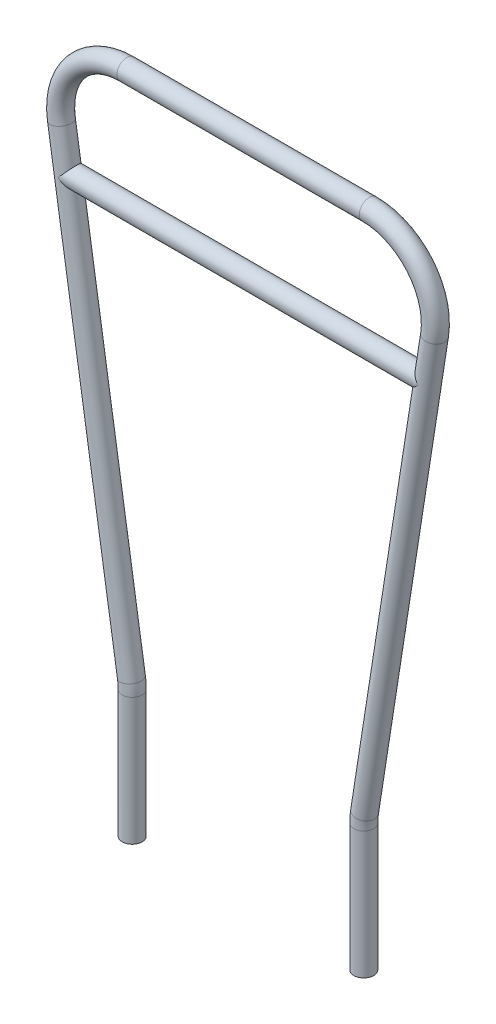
ISO-10303-21;
HEADER;
FILE_DESCRIPTION(('STEP AP214'),'2;1');
FILE_NAME('part.step','',(''),(''),'','','');
FILE_SCHEMA(('AUTOMOTIVE_DESIGN { 1 0 10303 214 1 1 1 1 }'));
ENDSEC;
DATA;
#1=APPLICATION_CONTEXT('core data for automotive mechanical design processes');
#2=APPLICATION_PROTOCOL_DEFINITION('international standard','automotive_design',2000,#1);
#3=PRODUCT_CONTEXT('',#1,'mechanical');
#4=PRODUCT('Part','Part','',(#3));
#5=PRODUCT_RELATED_PRODUCT_CATEGORY('part','',(#4));
#6=PRODUCT_DEFINITION_FORMATION('','',#4);
#7=PRODUCT_DEFINITION_CONTEXT('part definition',#1,'design');
#8=PRODUCT_DEFINITION('design','',#6,#7);
#9=PRODUCT_DEFINITION_SHAPE('','',#8);
#10=(LENGTH_UNIT() NAMED_UNIT(*) SI_UNIT(.MILLI.,.METRE.));
#11=(NAMED_UNIT(*) PLANE_ANGLE_UNIT() SI_UNIT($,.RADIAN.));
#12=(NAMED_UNIT(*) SI_UNIT($,.STERADIAN.) SOLID_ANGLE_UNIT());
#13=UNCERTAINTY_MEASURE_WITH_UNIT(LENGTH_MEASURE(1.E-05),#10,'distance_accuracy_value','');
#14=(GEOMETRIC_REPRESENTATION_CONTEXT(3) GLOBAL_UNCERTAINTY_ASSIGNED_CONTEXT((#13)) GLOBAL_UNIT_ASSIGNED_CONTEXT((#10,
#11,#12)) REPRESENTATION_CONTEXT('',''));
#15=CARTESIAN_POINT('',(0.,0.,0.));
#16=DIRECTION('',(0.,0.,1.));
#17=DIRECTION('',(1.,0.,0.));
#18=AXIS2_PLACEMENT_3D('',#15,#16,#17);
#19=CARTESIAN_POINT('',(350.,192.234610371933,0.));
#20=DIRECTION('',(0.,-1.,0.));
#21=DIRECTION('',(0.,0.,-1.));
#22=AXIS2_PLACEMENT_3D('',#19,#20,#21);
#23=CYLINDRICAL_SURFACE('',#22,15.);
#24=CARTESIAN_POINT('',(350.,192.234610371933,0.));
#25=DIRECTION('',(0.,-1.,0.));
#26=DIRECTION('',(0.,0.,1.));
#27=AXIS2_PLACEMENT_3D('',#24,#25,#26);
#28=CIRCLE('',#27,15.);
#29=CARTESIAN_POINT('',(335.,192.234610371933,0.));
#30=VERTEX_POINT('',#29);
#31=EDGE_CURVE('E170',#30,#30,#28,.T.);
#32=ORIENTED_EDGE('',*,*,#31,.T.);
#33=EDGE_LOOP('',(#32));
#34=FACE_BOUND('',#33,.T.);
#35=CARTESIAN_POINT('',(350.,-3.33066907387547E-13,0.));
#36=DIRECTION('',(0.,-1.,0.));
#37=DIRECTION('',(0.,0.,1.));
#38=AXIS2_PLACEMENT_3D('',#35,#36,#37);
#39=CIRCLE('',#38,15.);
#40=CARTESIAN_POINT('',(350.,-3.33066907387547E-13,15.));
#41=VERTEX_POINT('',#40);
#42=EDGE_CURVE('E11',#41,#41,#39,.T.);
#43=ORIENTED_EDGE('',*,*,#42,.F.);
#44=EDGE_LOOP('',(#43));
#45=FACE_BOUND('',#44,.T.);
#46=ADVANCED_FACE('F25',(#34,#45),#23,.T.);
#47=CARTESIAN_POINT('',(350.,192.234610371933,0.));
#48=DIRECTION('',(0.,-1.,0.));
#49=DIRECTION('',(0.,0.,-1.));
#50=AXIS2_PLACEMENT_3D('',#47,#48,#49);
#51=CYLINDRICAL_SURFACE('',#50,13.);
#52=CARTESIAN_POINT('',(350.,192.234610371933,0.));
#53=DIRECTION('',(0.,-1.,0.));
#54=DIRECTION('',(0.,0.,1.));
#55=AXIS2_PLACEMENT_3D('',#52,#53,#54);
#56=CIRCLE('',#55,13.);
#57=CARTESIAN_POINT('',(337.,192.234610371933,0.));
#58=VERTEX_POINT('',#57);
#59=EDGE_CURVE('E167',#58,#58,#56,.T.);
#60=ORIENTED_EDGE('',*,*,#59,.F.);
#61=EDGE_LOOP('',(#60));
#62=FACE_BOUND('',#61,.T.);
#63=CARTESIAN_POINT('',(350.,-3.33066907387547E-13,0.));
#64=DIRECTION('',(0.,-1.,0.));
#65=DIRECTION('',(0.,0.,1.));
#66=AXIS2_PLACEMENT_3D('',#63,#64,#65);
#67=CIRCLE('',#66,13.);
#68=CARTESIAN_POINT('',(350.,-3.33066907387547E-13,13.));
#69=VERTEX_POINT('',#68);
#70=EDGE_CURVE('E33',#69,#69,#67,.T.);
#71=ORIENTED_EDGE('',*,*,#70,.T.);
#72=EDGE_LOOP('',(#71));
#73=FACE_BOUND('',#72,.T.);
#74=ADVANCED_FACE('F156',(#62,#73),#51,.F.);
#75=CARTESIAN_POINT('',(450.,192.234610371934,0.));
#76=DIRECTION('',(0.,0.,1.));
#77=DIRECTION('',(1.,0.,0.));
#78=AXIS2_PLACEMENT_3D('',#75,#76,#77);
#79=TOROIDAL_SURFACE('',#78,100.,15.);
#80=CARTESIAN_POINT('',(351.19879662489,207.672298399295,0.));
#81=DIRECTION('',(-0.154376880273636,-0.988012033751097,0.));
#82=DIRECTION('',(0.,0.,1.));
#83=AXIS2_PLACEMENT_3D('',#80,#81,#82);
#84=CIRCLE('',#83,15.);
#85=CARTESIAN_POINT('',(336.378616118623,209.987951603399,0.));
#86=VERTEX_POINT('',#85);
#87=EDGE_CURVE('E175',#86,#86,#84,.T.);
#88=CARTESIAN_POINT('',(450.,192.234610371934,0.));
#89=DIRECTION('',(0.,0.,1.));
#90=DIRECTION('',(1.,0.,0.));
#91=AXIS2_PLACEMENT_3D('',#88,#89,#90);
#92=CIRCLE('',#91,115.);
#93=EDGE_CURVE('',#86,#30,#92,.T.);
#94=ORIENTED_EDGE('',*,*,#87,.T.);
#95=ORIENTED_EDGE('',*,*,#31,.F.);
#96=ORIENTED_EDGE('',*,*,#93,.T.);
#97=ORIENTED_EDGE('',*,*,#93,.F.);
#98=EDGE_LOOP('',(#94,#96,#95,#97));
#99=FACE_BOUND('',#98,.T.);
#100=ADVANCED_FACE('F153',(#99),#79,.T.);
#101=CARTESIAN_POINT('',(450.,192.234610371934,0.));
#102=DIRECTION('',(0.,0.,1.));
#103=DIRECTION('',(1.,0.,0.));
#104=AXIS2_PLACEMENT_3D('',#101,#102,#103);
#105=TOROIDAL_SURFACE('',#104,100.,13.);
#106=CARTESIAN_POINT('',(351.19879662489,207.672298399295,0.));
#107=DIRECTION('',(-0.154376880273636,-0.988012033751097,0.));
#108=DIRECTION('',(0.,0.,1.));
#109=AXIS2_PLACEMENT_3D('',#106,#107,#108);
#110=CIRCLE('',#109,13.);
#111=CARTESIAN_POINT('',(338.354640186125,209.679197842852,0.));
#112=VERTEX_POINT('',#111);
#113=EDGE_CURVE('E178',#112,#112,#110,.T.);
#114=CARTESIAN_POINT('',(450.,192.234610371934,0.));
#115=DIRECTION('',(0.,0.,1.));
#116=DIRECTION('',(1.,0.,0.));
#117=AXIS2_PLACEMENT_3D('',#114,#115,#116);
#118=CIRCLE('',#117,113.);
#119=EDGE_CURVE('',#112,#58,#118,.T.);
#120=ORIENTED_EDGE('',*,*,#113,.F.);
#121=ORIENTED_EDGE('',*,*,#59,.T.);
#122=ORIENTED_EDGE('',*,*,#119,.T.);
#123=ORIENTED_EDGE('',*,*,#119,.F.);
#124=EDGE_LOOP('',(#120,#122,#121,#123));
#125=FACE_BOUND('',#124,.T.);
#126=ADVANCED_FACE('F150',(#125),#105,.F.);
#127=CARTESIAN_POINT('',(456.962861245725,884.562311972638,0.));
#128=DIRECTION('',(-0.15437688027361,-0.988012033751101,0.));
#129=DIRECTION('',(0.988012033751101,-0.15437688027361,0.));
#130=AXIS2_PLACEMENT_3D('',#127,#128,#129);
#131=CYLINDRICAL_SURFACE('',#130,15.);
#132=CARTESIAN_POINT('',(447.005800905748,820.837125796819,0.));
#133=DIRECTION('',(-0.650239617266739,0.759729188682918,0.));
#134=DIRECTION('',(-0.759729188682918,-0.650239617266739,0.));
#135=AXIS2_PLACEMENT_3D('',#132,#133,#134);
#136=ELLIPSE('',#135,23.0684190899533,15.);
#137=CARTESIAN_POINT('',(447.005800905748,820.837125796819,-15.));
#138=VERTEX_POINT('',#137);
#139=CARTESIAN_POINT('',(447.005800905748,820.837125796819,15.));
#140=VERTEX_POINT('',#139);
#141=EDGE_CURVE('E51',#138,#140,#136,.T.);
#142=ORIENTED_EDGE('',*,*,#141,.F.);
#143=CARTESIAN_POINT('',(447.005800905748,820.837125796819,0.));
#144=DIRECTION('',(-0.759729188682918,-0.650239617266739,0.));
#145=DIRECTION('',(-0.650239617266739,0.759729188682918,0.));
#146=AXIS2_PLACEMENT_3D('',#143,#144,#145);
#147=ELLIPSE('',#146,19.7438774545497,15.);
#148=EDGE_CURVE('E39',#140,#138,#147,.T.);
#149=ORIENTED_EDGE('',*,*,#148,.F.);
#150=EDGE_LOOP('',(#142,#149));
#151=FACE_BOUND('',#150,.T.);
#152=CARTESIAN_POINT('',(456.962861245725,884.562311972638,0.));
#153=DIRECTION('',(-0.154376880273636,-0.988012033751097,0.));
#154=DIRECTION('',(0.,0.,1.));
#155=AXIS2_PLACEMENT_3D('',#152,#153,#154);
#156=CIRCLE('',#155,15.);
#157=CARTESIAN_POINT('',(471.783041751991,882.246658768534,0.));
#158=VERTEX_POINT('',#157);
#159=EDGE_CURVE('E181',#158,#158,#156,.T.);
#160=ORIENTED_EDGE('',*,*,#159,.T.);
#161=EDGE_LOOP('',(#160));
#162=FACE_BOUND('',#161,.T.);
#163=ORIENTED_EDGE('',*,*,#87,.F.);
#164=EDGE_LOOP('',(#163));
#165=FACE_BOUND('',#164,.T.);
#166=ADVANCED_FACE('F52',(#151,#162,#165),#131,.T.);
#167=CARTESIAN_POINT('',(456.962861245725,884.562311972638,0.));
#168=DIRECTION('',(-0.15437688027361,-0.988012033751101,0.));
#169=DIRECTION('',(0.988012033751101,-0.15437688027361,0.));
#170=AXIS2_PLACEMENT_3D('',#167,#168,#169);
#171=CYLINDRICAL_SURFACE('',#170,13.);
#172=CARTESIAN_POINT('',(456.962861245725,884.562311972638,0.));
#173=DIRECTION('',(-0.154376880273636,-0.988012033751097,0.));
#174=DIRECTION('',(0.,0.,1.));
#175=AXIS2_PLACEMENT_3D('',#172,#173,#174);
#176=CIRCLE('',#175,13.);
#177=CARTESIAN_POINT('',(469.807017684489,882.555412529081,0.));
#178=VERTEX_POINT('',#177);
#179=EDGE_CURVE('E184',#178,#178,#176,.T.);
#180=ORIENTED_EDGE('',*,*,#179,.F.);
#181=EDGE_LOOP('',(#180));
#182=FACE_BOUND('',#181,.T.);
#183=ORIENTED_EDGE('',*,*,#113,.T.);
#184=EDGE_LOOP('',(#183));
#185=FACE_BOUND('',#184,.T.);
#186=ADVANCED_FACE('F143',(#182,#185),#171,.F.);
#187=CARTESIAN_POINT('',(358.161657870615,900.,0.));
#188=DIRECTION('',(0.,0.,-1.));
#189=DIRECTION('',(-1.,0.,0.));
#190=AXIS2_PLACEMENT_3D('',#187,#188,#189);
#191=TOROIDAL_SURFACE('',#190,100.,15.);
#192=CARTESIAN_POINT('',(358.161657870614,1000.,0.));
#193=DIRECTION('',(1.,0.,0.));
#194=DIRECTION('',(0.,0.,1.));
#195=AXIS2_PLACEMENT_3D('',#192,#193,#194);
#196=CIRCLE('',#195,15.);
#197=CARTESIAN_POINT('',(358.161657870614,1015.,0.));
#198=VERTEX_POINT('',#197);
#199=EDGE_CURVE('E187',#198,#198,#196,.T.);
#200=CARTESIAN_POINT('',(358.161657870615,900.,0.));
#201=DIRECTION('',(0.,0.,-1.));
#202=DIRECTION('',(-1.,0.,0.));
#203=AXIS2_PLACEMENT_3D('',#200,#201,#202);
#204=CIRCLE('',#203,115.);
#205=EDGE_CURVE('',#198,#158,#204,.T.);
#206=ORIENTED_EDGE('',*,*,#199,.T.);
#207=ORIENTED_EDGE('',*,*,#159,.F.);
#208=ORIENTED_EDGE('',*,*,#205,.T.);
#209=ORIENTED_EDGE('',*,*,#205,.F.);
#210=EDGE_LOOP('',(#206,#208,#207,#209));
#211=FACE_BOUND('',#210,.T.);
#212=ADVANCED_FACE('F139',(#211),#191,.T.);
#213=CARTESIAN_POINT('',(358.161657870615,900.,0.));
#214=DIRECTION('',(0.,0.,-1.));
#215=DIRECTION('',(-1.,0.,0.));
#216=AXIS2_PLACEMENT_3D('',#213,#214,#215);
#217=TOROIDAL_SURFACE('',#216,100.,13.);
#218=CARTESIAN_POINT('',(358.161657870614,1000.,0.));
#219=DIRECTION('',(1.,0.,0.));
#220=DIRECTION('',(0.,0.,1.));
#221=AXIS2_PLACEMENT_3D('',#218,#219,#220);
#222=CIRCLE('',#221,13.);
#223=CARTESIAN_POINT('',(358.161657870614,1013.,0.));
#224=VERTEX_POINT('',#223);
#225=EDGE_CURVE('E190',#224,#224,#222,.T.);
#226=CARTESIAN_POINT('',(358.161657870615,900.,0.));
#227=DIRECTION('',(0.,0.,-1.));
#228=DIRECTION('',(-1.,0.,0.));
#229=AXIS2_PLACEMENT_3D('',#226,#227,#228);
#230=CIRCLE('',#229,113.);
#231=EDGE_CURVE('',#224,#178,#230,.T.);
#232=ORIENTED_EDGE('',*,*,#225,.F.);
#233=ORIENTED_EDGE('',*,*,#179,.T.);
#234=ORIENTED_EDGE('',*,*,#231,.T.);
#235=ORIENTED_EDGE('',*,*,#231,.F.);
#236=EDGE_LOOP('',(#232,#234,#233,#235));
#237=FACE_BOUND('',#236,.T.);
#238=ADVANCED_FACE('F135',(#237),#217,.F.);
#239=CARTESIAN_POINT('',(-8.16165787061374,1000.,0.));
#240=DIRECTION('',(1.,0.,0.));
#241=DIRECTION('',(0.,0.,-1.));
#242=AXIS2_PLACEMENT_3D('',#239,#240,#241);
#243=CYLINDRICAL_SURFACE('',#242,15.);
#244=CARTESIAN_POINT('',(-8.16165787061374,1000.,0.));
#245=DIRECTION('',(1.,0.,0.));
#246=DIRECTION('',(0.,0.,1.));
#247=AXIS2_PLACEMENT_3D('',#244,#245,#246);
#248=CIRCLE('',#247,15.);
#249=CARTESIAN_POINT('',(-8.16165787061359,1015.,0.));
#250=VERTEX_POINT('',#249);
#251=EDGE_CURVE('E193',#250,#250,#248,.T.);
#252=ORIENTED_EDGE('',*,*,#251,.T.);
#253=EDGE_LOOP('',(#252));
#254=FACE_BOUND('',#253,.T.);
#255=ORIENTED_EDGE('',*,*,#199,.F.);
#256=EDGE_LOOP('',(#255));
#257=FACE_BOUND('',#256,.T.);
#258=ADVANCED_FACE('F131',(#254,#257),#243,.T.);
#259=CARTESIAN_POINT('',(-8.16165787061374,1000.,0.));
#260=DIRECTION('',(1.,0.,0.));
#261=DIRECTION('',(0.,0.,-1.));
#262=AXIS2_PLACEMENT_3D('',#259,#260,#261);
#263=CYLINDRICAL_SURFACE('',#262,13.);
#264=CARTESIAN_POINT('',(-8.16165787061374,1000.,0.));
#265=DIRECTION('',(1.,0.,0.));
#266=DIRECTION('',(0.,0.,1.));
#267=AXIS2_PLACEMENT_3D('',#264,#265,#266);
#268=CIRCLE('',#267,13.);
#269=CARTESIAN_POINT('',(-8.16165787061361,1013.,0.));
#270=VERTEX_POINT('',#269);
#271=EDGE_CURVE('E196',#270,#270,#268,.T.);
#272=ORIENTED_EDGE('',*,*,#271,.F.);
#273=EDGE_LOOP('',(#272));
#274=FACE_BOUND('',#273,.T.);
#275=ORIENTED_EDGE('',*,*,#225,.T.);
#276=EDGE_LOOP('',(#275));
#277=FACE_BOUND('',#276,.T.);
#278=ADVANCED_FACE('F127',(#274,#277),#263,.F.);
#279=CARTESIAN_POINT('',(-8.16165787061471,900.,0.));
#280=DIRECTION('',(0.,0.,-1.));
#281=DIRECTION('',(-1.,0.,0.));
#282=AXIS2_PLACEMENT_3D('',#279,#280,#281);
#283=TOROIDAL_SURFACE('',#282,100.,15.);
#284=CARTESIAN_POINT('',(-106.962861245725,884.562311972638,0.));
#285=DIRECTION('',(-0.154376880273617,0.9880120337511,0.));
#286=DIRECTION('',(0.,0.,1.));
#287=AXIS2_PLACEMENT_3D('',#284,#285,#286);
#288=CIRCLE('',#287,15.);
#289=CARTESIAN_POINT('',(-121.783041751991,882.246658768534,0.));
#290=VERTEX_POINT('',#289);
#291=EDGE_CURVE('E199',#290,#290,#288,.T.);
#292=CARTESIAN_POINT('',(-8.16165787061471,900.,0.));
#293=DIRECTION('',(0.,0.,-1.));
#294=DIRECTION('',(-1.,0.,0.));
#295=AXIS2_PLACEMENT_3D('',#292,#293,#294);
#296=CIRCLE('',#295,115.);
#297=EDGE_CURVE('',#290,#250,#296,.T.);
#298=ORIENTED_EDGE('',*,*,#291,.T.);
#299=ORIENTED_EDGE('',*,*,#251,.F.);
#300=ORIENTED_EDGE('',*,*,#297,.T.);
#301=ORIENTED_EDGE('',*,*,#297,.F.);
#302=EDGE_LOOP('',(#298,#300,#299,#301));
#303=FACE_BOUND('',#302,.T.);
#304=ADVANCED_FACE('F123',(#303),#283,.T.);
#305=CARTESIAN_POINT('',(-8.16165787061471,900.,0.));
#306=DIRECTION('',(0.,0.,-1.));
#307=DIRECTION('',(-1.,0.,0.));
#308=AXIS2_PLACEMENT_3D('',#305,#306,#307);
#309=TOROIDAL_SURFACE('',#308,100.,13.);
#310=CARTESIAN_POINT('',(-106.962861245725,884.562311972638,0.));
#311=DIRECTION('',(-0.154376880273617,0.9880120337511,0.));
#312=DIRECTION('',(0.,0.,1.));
#313=AXIS2_PLACEMENT_3D('',#310,#311,#312);
#314=CIRCLE('',#313,13.);
#315=CARTESIAN_POINT('',(-119.807017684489,882.555412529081,0.));
#316=VERTEX_POINT('',#315);
#317=EDGE_CURVE('E202',#316,#316,#314,.T.);
#318=CARTESIAN_POINT('',(-8.16165787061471,900.,0.));
#319=DIRECTION('',(0.,0.,-1.));
#320=DIRECTION('',(-1.,0.,0.));
#321=AXIS2_PLACEMENT_3D('',#318,#319,#320);
#322=CIRCLE('',#321,113.);
#323=EDGE_CURVE('',#316,#270,#322,.T.);
#324=ORIENTED_EDGE('',*,*,#317,.F.);
#325=ORIENTED_EDGE('',*,*,#271,.T.);
#326=ORIENTED_EDGE('',*,*,#323,.T.);
#327=ORIENTED_EDGE('',*,*,#323,.F.);
#328=EDGE_LOOP('',(#324,#326,#325,#327));
#329=FACE_BOUND('',#328,.T.);
#330=ADVANCED_FACE('F120',(#329),#309,.F.);
#331=CARTESIAN_POINT('',(-1.19879662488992,207.672298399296,0.));
#332=DIRECTION('',(-0.15437688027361,0.988012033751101,0.));
#333=DIRECTION('',(-0.988012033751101,-0.15437688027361,0.));
#334=AXIS2_PLACEMENT_3D('',#331,#332,#333);
#335=CYLINDRICAL_SURFACE('',#334,15.);
#336=CARTESIAN_POINT('',(-97.0058009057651,820.837125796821,0.));
#337=DIRECTION('',(0.650239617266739,0.759729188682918,0.));
#338=DIRECTION('',(0.759729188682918,-0.650239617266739,0.));
#339=AXIS2_PLACEMENT_3D('',#336,#337,#338);
#340=ELLIPSE('',#339,23.0684190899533,15.);
#341=CARTESIAN_POINT('',(-97.0058009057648,820.837125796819,-15.));
#342=VERTEX_POINT('',#341);
#343=CARTESIAN_POINT('',(-97.0058009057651,820.837125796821,15.));
#344=VERTEX_POINT('',#343);
#345=EDGE_CURVE('E73',#342,#344,#340,.F.);
#346=ORIENTED_EDGE('',*,*,#345,.T.);
#347=CARTESIAN_POINT('',(-97.0058009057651,820.837125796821,0.));
#348=DIRECTION('',(0.759729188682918,-0.650239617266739,0.));
#349=DIRECTION('',(0.650239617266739,0.759729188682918,0.));
#350=AXIS2_PLACEMENT_3D('',#347,#348,#349);
#351=ELLIPSE('',#350,19.7438774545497,15.);
#352=EDGE_CURVE('E46',#344,#342,#351,.F.);
#353=ORIENTED_EDGE('',*,*,#352,.T.);
#354=EDGE_LOOP('',(#346,#353));
#355=FACE_BOUND('',#354,.T.);
#356=CARTESIAN_POINT('',(-1.19879662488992,207.672298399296,0.));
#357=DIRECTION('',(-0.154376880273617,0.9880120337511,0.));
#358=DIRECTION('',(0.,0.,1.));
#359=AXIS2_PLACEMENT_3D('',#356,#357,#358);
#360=CIRCLE('',#359,15.);
#361=CARTESIAN_POINT('',(13.6213838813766,209.9879516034,0.));
#362=VERTEX_POINT('',#361);
#363=EDGE_CURVE('E205',#362,#362,#360,.T.);
#364=ORIENTED_EDGE('',*,*,#363,.T.);
#365=EDGE_LOOP('',(#364));
#366=FACE_BOUND('',#365,.T.);
#367=ORIENTED_EDGE('',*,*,#291,.F.);
#368=EDGE_LOOP('',(#367));
#369=FACE_BOUND('',#368,.T.);
#370=ADVANCED_FACE('F116',(#355,#366,#369),#335,.T.);
#371=CARTESIAN_POINT('',(-1.19879662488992,207.672298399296,0.));
#372=DIRECTION('',(-0.15437688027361,0.988012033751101,0.));
#373=DIRECTION('',(-0.988012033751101,-0.15437688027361,0.));
#374=AXIS2_PLACEMENT_3D('',#371,#372,#373);
#375=CYLINDRICAL_SURFACE('',#374,13.);
#376=CARTESIAN_POINT('',(-1.19879662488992,207.672298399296,0.));
#377=DIRECTION('',(-0.154376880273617,0.9880120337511,0.));
#378=DIRECTION('',(0.,0.,1.));
#379=AXIS2_PLACEMENT_3D('',#376,#377,#378);
#380=CIRCLE('',#379,13.);
#381=CARTESIAN_POINT('',(11.6453598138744,209.679197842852,0.));
#382=VERTEX_POINT('',#381);
#383=EDGE_CURVE('E208',#382,#382,#380,.T.);
#384=ORIENTED_EDGE('',*,*,#383,.F.);
#385=EDGE_LOOP('',(#384));
#386=FACE_BOUND('',#385,.T.);
#387=ORIENTED_EDGE('',*,*,#317,.T.);
#388=EDGE_LOOP('',(#387));
#389=FACE_BOUND('',#388,.T.);
#390=ADVANCED_FACE('F112',(#386,#389),#375,.F.);
#391=CARTESIAN_POINT('',(-100.,192.234610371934,0.));
#392=DIRECTION('',(0.,0.,1.));
#393=DIRECTION('',(1.,0.,0.));
#394=AXIS2_PLACEMENT_3D('',#391,#392,#393);
#395=TOROIDAL_SURFACE('',#394,100.,15.);
#396=CARTESIAN_POINT('',(0.,192.234610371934,0.));
#397=DIRECTION('',(0.,1.,0.));
#398=DIRECTION('',(0.,0.,1.));
#399=AXIS2_PLACEMENT_3D('',#396,#397,#398);
#400=CIRCLE('',#399,15.);
#401=CARTESIAN_POINT('',(15.,192.234610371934,0.));
#402=VERTEX_POINT('',#401);
#403=EDGE_CURVE('E211',#402,#402,#400,.T.);
#404=CARTESIAN_POINT('',(-100.,192.234610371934,0.));
#405=DIRECTION('',(0.,0.,1.));
#406=DIRECTION('',(1.,0.,0.));
#407=AXIS2_PLACEMENT_3D('',#404,#405,#406);
#408=CIRCLE('',#407,115.);
#409=EDGE_CURVE('',#402,#362,#408,.T.);
#410=ORIENTED_EDGE('',*,*,#403,.T.);
#411=ORIENTED_EDGE('',*,*,#363,.F.);
#412=ORIENTED_EDGE('',*,*,#409,.T.);
#413=ORIENTED_EDGE('',*,*,#409,.F.);
#414=EDGE_LOOP('',(#410,#412,#411,#413));
#415=FACE_BOUND('',#414,.T.);
#416=ADVANCED_FACE('F108',(#415),#395,.T.);
#417=CARTESIAN_POINT('',(-100.,192.234610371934,0.));
#418=DIRECTION('',(0.,0.,1.));
#419=DIRECTION('',(1.,0.,0.));
#420=AXIS2_PLACEMENT_3D('',#417,#418,#419);
#421=TOROIDAL_SURFACE('',#420,100.,13.);
#422=CARTESIAN_POINT('',(0.,192.234610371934,0.));
#423=DIRECTION('',(0.,1.,0.));
#424=DIRECTION('',(0.,0.,1.));
#425=AXIS2_PLACEMENT_3D('',#422,#423,#424);
#426=CIRCLE('',#425,13.);
#427=CARTESIAN_POINT('',(13.,192.234610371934,0.));
#428=VERTEX_POINT('',#427);
#429=EDGE_CURVE('E214',#428,#428,#426,.T.);
#430=CARTESIAN_POINT('',(-100.,192.234610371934,0.));
#431=DIRECTION('',(0.,0.,1.));
#432=DIRECTION('',(1.,0.,0.));
#433=AXIS2_PLACEMENT_3D('',#430,#431,#432);
#434=CIRCLE('',#433,113.);
#435=EDGE_CURVE('',#428,#382,#434,.T.);
#436=ORIENTED_EDGE('',*,*,#429,.F.);
#437=ORIENTED_EDGE('',*,*,#383,.T.);
#438=ORIENTED_EDGE('',*,*,#435,.T.);
#439=ORIENTED_EDGE('',*,*,#435,.F.);
#440=EDGE_LOOP('',(#436,#438,#437,#439));
#441=FACE_BOUND('',#440,.T.);
#442=ADVANCED_FACE('F104',(#441),#421,.F.);
#443=CARTESIAN_POINT('',(0.,192.234610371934,0.));
#444=DIRECTION('',(0.,-1.,0.));
#445=DIRECTION('',(0.,0.,-1.));
#446=AXIS2_PLACEMENT_3D('',#443,#444,#445);
#447=CYLINDRICAL_SURFACE('',#446,13.);
#448=ORIENTED_EDGE('',*,*,#429,.T.);
#449=EDGE_LOOP('',(#448));
#450=FACE_BOUND('',#449,.T.);
#451=CARTESIAN_POINT('',(0.,0.,0.));
#452=DIRECTION('',(0.,1.,0.));
#453=DIRECTION('',(0.,0.,1.));
#454=AXIS2_PLACEMENT_3D('',#451,#452,#453);
#455=CIRCLE('',#454,13.);
#456=CARTESIAN_POINT('',(0.,0.,13.));
#457=VERTEX_POINT('',#456);
#458=EDGE_CURVE('E220',#457,#457,#455,.T.);
#459=ORIENTED_EDGE('',*,*,#458,.F.);
#460=EDGE_LOOP('',(#459));
#461=FACE_BOUND('',#460,.T.);
#462=ADVANCED_FACE('F100',(#450,#461),#447,.F.);
#463=CARTESIAN_POINT('',(0.,192.234610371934,0.));
#464=DIRECTION('',(0.,-1.,0.));
#465=DIRECTION('',(0.,0.,-1.));
#466=AXIS2_PLACEMENT_3D('',#463,#464,#465);
#467=CYLINDRICAL_SURFACE('',#466,15.);
#468=ORIENTED_EDGE('',*,*,#403,.F.);
#469=EDGE_LOOP('',(#468));
#470=FACE_BOUND('',#469,.T.);
#471=CARTESIAN_POINT('',(0.,0.,0.));
#472=DIRECTION('',(0.,1.,0.));
#473=DIRECTION('',(0.,0.,1.));
#474=AXIS2_PLACEMENT_3D('',#471,#472,#473);
#475=CIRCLE('',#474,15.);
#476=CARTESIAN_POINT('',(0.,0.,15.));
#477=VERTEX_POINT('',#476);
#478=EDGE_CURVE('E217',#477,#477,#475,.T.);
#479=ORIENTED_EDGE('',*,*,#478,.T.);
#480=EDGE_LOOP('',(#479));
#481=FACE_BOUND('',#480,.T.);
#482=ADVANCED_FACE('F96',(#470,#481),#467,.T.);
#483=CARTESIAN_POINT('',(350.,-3.33066907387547E-13,0.));
#484=DIRECTION('',(0.,-1.,0.));
#485=DIRECTION('',(0.,0.,1.));
#486=AXIS2_PLACEMENT_3D('',#483,#484,#485);
#487=PLANE('',#486);
#488=ORIENTED_EDGE('',*,*,#70,.F.);
#489=EDGE_LOOP('',(#488));
#490=FACE_BOUND('',#489,.T.);
#491=ORIENTED_EDGE('',*,*,#42,.T.);
#492=EDGE_LOOP('',(#491));
#493=FACE_BOUND('',#492,.T.);
#494=ADVANCED_FACE('F92',(#490,#493),#487,.T.);
#495=CARTESIAN_POINT('',(0.,0.,0.));
#496=DIRECTION('',(0.,1.,0.));
#497=DIRECTION('',(0.,0.,1.));
#498=AXIS2_PLACEMENT_3D('',#495,#496,#497);
#499=PLANE('',#498);
#500=ORIENTED_EDGE('',*,*,#458,.T.);
#501=EDGE_LOOP('',(#500));
#502=FACE_BOUND('',#501,.T.);
#503=ORIENTED_EDGE('',*,*,#478,.F.);
#504=EDGE_LOOP('',(#503));
#505=FACE_BOUND('',#504,.T.);
#506=ADVANCED_FACE('F88',(#502,#505),#499,.F.);
#507=CARTESIAN_POINT('',(-500000.,820.837125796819,0.));
#508=DIRECTION('',(1.,0.,0.));
#509=DIRECTION('',(0.,0.,-1.));
#510=AXIS2_PLACEMENT_3D('',#507,#508,#509);
#511=CYLINDRICAL_SURFACE('',#510,15.);
#512=ORIENTED_EDGE('',*,*,#345,.F.);
#513=ORIENTED_EDGE('',*,*,#352,.F.);
#514=EDGE_LOOP('',(#512,#513));
#515=FACE_BOUND('',#514,.T.);
#516=ORIENTED_EDGE('',*,*,#141,.T.);
#517=ORIENTED_EDGE('',*,*,#148,.T.);
#518=EDGE_LOOP('',(#516,#517));
#519=FACE_BOUND('',#518,.T.);
#520=ADVANCED_FACE('F57',(#515,#519),#511,.T.);
#521=CLOSED_SHELL('',(#46,#74,#100,#126,#166,#186,#212,#238,#258,#278,#304,#330,#370,#390,#416,
#442,#462,#482,#494,#506,#520));
#522=CARTESIAN_POINT('',(-89.4316879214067,820.837125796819,-13.));
#523=CARTESIAN_POINT('',(-89.3944816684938,820.598997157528,-13.000000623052));
#524=CARTESIAN_POINT('',(-89.3459818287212,820.362649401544,-12.9934393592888));
#525=CARTESIAN_POINT('',(-89.2285181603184,819.895681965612,-12.9679775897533));
#526=CARTESIAN_POINT('',(-89.1595397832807,819.665066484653,-12.9490683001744));
#527=CARTESIAN_POINT('',(-89.0038573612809,819.210164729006,-12.8998288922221));
#528=CARTESIAN_POINT('',(-88.9170812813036,818.985908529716,-12.8694519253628));
#529=CARTESIAN_POINT('',(-88.7292442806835,818.545257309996,-12.7983263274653));
#530=CARTESIAN_POINT('',(-88.6281833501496,818.328862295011,-12.7575776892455));
#531=CARTESIAN_POINT('',(-88.3537515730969,817.782247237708,-12.6405910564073));
#532=CARTESIAN_POINT('',(-88.17207619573,817.457693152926,-12.5573831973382));
#533=CARTESIAN_POINT('',(-87.7902607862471,816.82594192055,-12.370087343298));
#534=CARTESIAN_POINT('',(-87.5901073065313,816.518757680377,-12.2659840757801));
#535=CARTESIAN_POINT('',(-87.1776528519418,815.919066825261,-12.0380981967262));
#536=CARTESIAN_POINT('',(-86.9653219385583,815.626600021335,-11.9142656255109));
#537=CARTESIAN_POINT('',(-86.5340053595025,815.055618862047,-11.6478908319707));
#538=CARTESIAN_POINT('',(-86.315020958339,814.777101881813,-11.5053521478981));
#539=CARTESIAN_POINT('',(-85.788046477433,814.126521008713,-11.1425157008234));
#540=CARTESIAN_POINT('',(-85.4786690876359,813.760362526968,-10.913579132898));
#541=CARTESIAN_POINT('',(-84.8620247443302,813.051147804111,-10.4194685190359));
#542=CARTESIAN_POINT('',(-84.5547588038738,812.708102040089,-10.1542782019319));
#543=CARTESIAN_POINT('',(-83.9498278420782,812.046524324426,-9.58720816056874));
#544=CARTESIAN_POINT('',(-83.6521413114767,811.72793484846,-9.28541912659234));
#545=CARTESIAN_POINT('',(-83.0723914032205,811.116768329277,-8.64355480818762));
#546=CARTESIAN_POINT('',(-82.7903178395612,810.824174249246,-8.3035049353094));
#547=CARTESIAN_POINT('',(-82.172348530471,810.19025030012,-7.48217216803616));
#548=CARTESIAN_POINT('',(-81.843515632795,809.858234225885,-6.98801267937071));
#549=CARTESIAN_POINT('',(-81.3912039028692,809.405785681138,-6.19810408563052));
#550=CARTESIAN_POINT('',(-81.2472875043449,809.262595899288,-5.92676447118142));
#551=CARTESIAN_POINT('',(-80.975385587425,808.993142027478,-5.3680669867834));
#552=CARTESIAN_POINT('',(-80.84739733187,808.866875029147,-5.08071188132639));
#553=CARTESIAN_POINT('',(-80.6308294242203,808.653886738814,-4.5428021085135));
#554=CARTESIAN_POINT('',(-80.539276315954,808.564114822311,-4.29464749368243));
#555=CARTESIAN_POINT('',(-80.3702433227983,808.398717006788,-3.7890232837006));
#556=CARTESIAN_POINT('',(-80.2927603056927,808.323087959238,-3.53155577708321));
#557=CARTESIAN_POINT('',(-80.1532917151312,808.187173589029,-3.00859751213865));
#558=CARTESIAN_POINT('',(-80.0912994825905,808.126881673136,-2.74311025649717));
#559=CARTESIAN_POINT('',(-79.9840281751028,808.02266970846,-2.20559453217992));
#560=CARTESIAN_POINT('',(-79.9387491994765,807.97874975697,-1.93356602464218));
#561=CARTESIAN_POINT('',(-79.8657088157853,807.907948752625,-1.38337657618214));
#562=CARTESIAN_POINT('',(-79.8380470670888,807.881164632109,-1.10518980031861));
#563=CARTESIAN_POINT('',(-79.8013081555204,807.845599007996,-0.546436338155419));
#564=CARTESIAN_POINT('',(-79.792231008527,807.83681751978,-0.265869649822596));
#565=CARTESIAN_POINT('',(-79.7928852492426,807.837450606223,0.295189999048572));
#566=CARTESIAN_POINT('',(-79.8026146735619,807.846863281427,0.575682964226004));
#567=CARTESIAN_POINT('',(-79.8406390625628,807.883674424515,1.13420291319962));
#568=CARTESIAN_POINT('',(-79.8689332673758,807.911072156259,1.41222999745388));
#569=CARTESIAN_POINT('',(-79.9401402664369,807.980100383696,1.93939969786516));
#570=CARTESIAN_POINT('',(-79.9815557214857,808.020274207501,2.18893945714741));
#571=CARTESIAN_POINT('',(-80.0784907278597,808.114432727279,2.68257556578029));
#572=CARTESIAN_POINT('',(-80.134008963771,808.168416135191,2.92667242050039));
#573=CARTESIAN_POINT('',(-80.2582069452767,808.289393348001,3.40823462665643));
#574=CARTESIAN_POINT('',(-80.3268892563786,808.356389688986,3.64569867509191));
#575=CARTESIAN_POINT('',(-80.4763422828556,808.502489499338,4.11299273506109));
#576=CARTESIAN_POINT('',(-80.5571155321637,808.581595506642,4.34282113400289));
#577=CARTESIAN_POINT('',(-80.7622718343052,808.783035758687,4.87946983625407));
#578=CARTESIAN_POINT('',(-80.8915936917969,808.910403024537,5.18252936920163));
#579=CARTESIAN_POINT('',(-81.1681330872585,809.183992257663,5.7714825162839));
#580=CARTESIAN_POINT('',(-81.3153562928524,809.330220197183,6.05737065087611));
#581=CARTESIAN_POINT('',(-81.6251335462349,809.639594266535,6.61182564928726));
#582=CARTESIAN_POINT('',(-81.7877126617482,809.802768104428,6.88036294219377));
#583=CARTESIAN_POINT('',(-82.1253859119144,810.143931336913,7.39946469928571));
#584=CARTESIAN_POINT('',(-82.3004803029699,810.321921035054,7.65002879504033));
#585=CARTESIAN_POINT('',(-82.7317036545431,810.763778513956,8.22844249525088));
#586=CARTESIAN_POINT('',(-82.9926316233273,811.033901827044,8.54795657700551));
#587=CARTESIAN_POINT('',(-83.5285482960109,811.596816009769,9.15356375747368));
#588=CARTESIAN_POINT('',(-83.8035435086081,811.889617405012,9.43964118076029));
#589=CARTESIAN_POINT('',(-84.3627513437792,812.496471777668,9.97992217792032));
#590=CARTESIAN_POINT('',(-84.6469799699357,812.81056280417,10.2340662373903));
#591=CARTESIAN_POINT('',(-85.2188040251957,813.458733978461,10.710798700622));
#592=CARTESIAN_POINT('',(-85.5063983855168,813.792807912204,10.9333968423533));
#593=CARTESIAN_POINT('',(-86.0230680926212,814.414280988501,11.3071456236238));
#594=CARTESIAN_POINT('',(-86.2525932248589,814.698038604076,11.4637568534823));
#595=CARTESIAN_POINT('',(-86.7062749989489,815.280056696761,11.7569220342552));
#596=CARTESIAN_POINT('',(-86.9304303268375,815.578320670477,11.893471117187));
#597=CARTESIAN_POINT('',(-87.3677367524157,816.190064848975,12.1455350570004));
#598=CARTESIAN_POINT('',(-87.580915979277,816.503501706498,12.261105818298));
#599=CARTESIAN_POINT('',(-87.990040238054,817.148393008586,12.4702869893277));
#600=CARTESIAN_POINT('',(-88.1859991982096,817.479832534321,12.5639152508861));
#601=CARTESIAN_POINT('',(-88.4673569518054,818.006197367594,12.6894401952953));
#602=CARTESIAN_POINT('',(-88.5622437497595,818.19401693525,12.7299549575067));
#603=CARTESIAN_POINT('',(-88.7422426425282,818.575829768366,12.8032942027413));
#604=CARTESIAN_POINT('',(-88.8273535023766,818.769823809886,12.8361177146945));
#605=CARTESIAN_POINT('',(-88.9854724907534,819.163497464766,12.893348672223));
#606=CARTESIAN_POINT('',(-89.0585035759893,819.363165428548,12.9177721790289));
#607=CARTESIAN_POINT('',(-89.190375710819,819.767947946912,12.957552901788));
#608=CARTESIAN_POINT('',(-89.2492244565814,819.9730594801,12.9729150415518));
#609=CARTESIAN_POINT('',(-89.3514124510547,820.390636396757,12.9940341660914));
#610=CARTESIAN_POINT('',(-89.3945280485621,820.603164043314,12.9996566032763));
#611=CARTESIAN_POINT('',(-89.4625514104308,821.031136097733,13.0003127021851));
#612=CARTESIAN_POINT('',(-89.4874609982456,821.246580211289,12.9953474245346));
#613=CARTESIAN_POINT('',(-89.518533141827,821.678321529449,12.9745558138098));
#614=CARTESIAN_POINT('',(-89.5246933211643,821.894618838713,12.9587281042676));
#615=CARTESIAN_POINT('',(-89.5188746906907,822.325901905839,12.916289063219));
#616=CARTESIAN_POINT('',(-89.5068932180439,822.540887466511,12.8896761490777));
#617=CARTESIAN_POINT('',(-89.464358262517,822.988936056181,12.8228699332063));
#618=CARTESIAN_POINT('',(-89.4320756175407,823.221669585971,12.7815889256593));
#619=CARTESIAN_POINT('',(-89.3504072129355,823.681618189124,12.6871601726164));
#620=CARTESIAN_POINT('',(-89.30101825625,823.908832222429,12.6340102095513));
#621=CARTESIAN_POINT('',(-89.1881144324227,824.357433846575,12.5164439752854));
#622=CARTESIAN_POINT('',(-89.1245585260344,824.57880237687,12.4519950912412));
#623=CARTESIAN_POINT('',(-88.9863305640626,825.014692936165,12.3126082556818));
#624=CARTESIAN_POINT('',(-88.911654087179,825.22921220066,12.2376661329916));
#625=CARTESIAN_POINT('',(-88.7048880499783,825.782058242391,12.0283525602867));
#626=CARTESIAN_POINT('',(-88.5658878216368,826.114766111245,11.8859234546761));
#627=CARTESIAN_POINT('',(-88.2742554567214,826.762440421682,11.5766808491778));
#628=CARTESIAN_POINT('',(-88.1216152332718,827.077396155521,11.4098528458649));
#629=CARTESIAN_POINT('',(-87.8089552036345,827.69024336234,11.0526312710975));
#630=CARTESIAN_POINT('',(-87.648928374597,827.988117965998,10.862214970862));
#631=CARTESIAN_POINT('',(-87.3265543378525,828.566496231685,10.4585450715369));
#632=CARTESIAN_POINT('',(-87.1642076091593,828.847003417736,10.2452961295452));
#633=CARTESIAN_POINT('',(-86.832798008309,829.404260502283,9.78475595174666));
#634=CARTESIAN_POINT('',(-86.6638169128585,829.680082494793,9.53628069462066));
#635=CARTESIAN_POINT('',(-86.3314474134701,830.211191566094,9.01473255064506));
#636=CARTESIAN_POINT('',(-86.1680596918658,830.466476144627,8.74165667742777));
#637=CARTESIAN_POINT('',(-85.850635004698,830.954532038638,8.17181737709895));
#638=CARTESIAN_POINT('',(-85.6965845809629,831.187336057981,7.87508954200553));
#639=CARTESIAN_POINT('',(-85.4008968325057,831.628765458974,7.25838929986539));
#640=CARTESIAN_POINT('',(-85.2592565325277,831.837396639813,6.93842249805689));
#641=CARTESIAN_POINT('',(-85.0166259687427,832.19148711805,6.33845922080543));
#642=CARTESIAN_POINT('',(-84.9129891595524,832.341461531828,6.06219007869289));
#643=CARTESIAN_POINT('',(-84.717677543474,832.622395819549,5.49610839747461));
#644=CARTESIAN_POINT('',(-84.6260004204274,832.753359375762,5.20629849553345));
#645=CARTESIAN_POINT('',(-84.4562080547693,832.994777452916,4.61449830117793));
#646=CARTESIAN_POINT('',(-84.378088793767,833.105238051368,4.31251165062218));
#647=CARTESIAN_POINT('',(-84.2368435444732,833.304258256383,3.69796080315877));
#648=CARTESIAN_POINT('',(-84.1737177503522,833.392817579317,3.38539646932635));
#649=CARTESIAN_POINT('',(-84.0634186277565,833.547176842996,2.74993096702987));
#650=CARTESIAN_POINT('',(-84.0163403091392,833.612841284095,2.42698021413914));
#651=CARTESIAN_POINT('',(-83.9396736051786,833.719616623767,1.77497751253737));
#652=CARTESIAN_POINT('',(-83.9100853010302,833.760727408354,1.44592553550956));
#653=CARTESIAN_POINT('',(-83.869081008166,833.817667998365,0.784619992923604));
#654=CARTESIAN_POINT('',(-83.8576589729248,833.833506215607,0.452367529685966));
#655=CARTESIAN_POINT('',(-83.8532380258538,833.839638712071,-0.212481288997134));
#656=CARTESIAN_POINT('',(-83.8602376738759,833.82993498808,-0.545077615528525));
#657=CARTESIAN_POINT('',(-83.8909354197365,833.787324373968,-1.1757821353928));
#658=CARTESIAN_POINT('',(-83.9129640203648,833.756737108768,-1.47413282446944));
#659=CARTESIAN_POINT('',(-83.9715105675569,833.675295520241,-2.06658971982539));
#660=CARTESIAN_POINT('',(-84.0080274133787,833.624442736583,-2.36069624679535));
#661=CARTESIAN_POINT('',(-84.0948931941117,833.503160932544,-2.94278073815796));
#662=CARTESIAN_POINT('',(-84.1452436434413,833.432729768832,-3.23075802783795));
#663=CARTESIAN_POINT('',(-84.2589075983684,833.273189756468,-3.79886504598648));
#664=CARTESIAN_POINT('',(-84.3222216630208,833.184080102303,-4.07899443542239));
#665=CARTESIAN_POINT('',(-84.4625227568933,832.985761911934,-4.63685915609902));
#666=CARTESIAN_POINT('',(-84.5398124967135,832.876105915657,-4.91435883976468));
#667=CARTESIAN_POINT('',(-84.7057081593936,832.639440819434,-5.45832866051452));
#668=CARTESIAN_POINT('',(-84.7943141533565,832.512431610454,-5.72479872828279));
#669=CARTESIAN_POINT('',(-84.9815181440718,832.242282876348,-6.24567463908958));
#670=CARTESIAN_POINT('',(-85.0801138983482,832.099146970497,-6.50008317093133));
#671=CARTESIAN_POINT('',(-85.2859732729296,831.797850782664,-6.99619606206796));
#672=CARTESIAN_POINT('',(-85.3932381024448,831.639688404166,-7.23789864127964));
#673=CARTESIAN_POINT('',(-85.6314170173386,831.285026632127,-7.74274221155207));
#674=CARTESIAN_POINT('',(-85.7634854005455,831.086313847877,-8.00378503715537));
#675=CARTESIAN_POINT('',(-86.035068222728,830.671888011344,-8.50787574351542));
#676=CARTESIAN_POINT('',(-86.174583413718,830.456173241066,-8.7509218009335));
#677=CARTESIAN_POINT('',(-86.4591741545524,830.008317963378,-9.2192450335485));
#678=CARTESIAN_POINT('',(-86.6042627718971,829.776137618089,-9.44447611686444));
#679=CARTESIAN_POINT('',(-86.8972463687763,829.296662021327,-9.87625176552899));
#680=CARTESIAN_POINT('',(-87.0451415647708,829.049365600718,-10.0827948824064));
#681=CARTESIAN_POINT('',(-87.3695634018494,828.491070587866,-10.5149732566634));
#682=CARTESIAN_POINT('',(-87.5461141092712,828.176981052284,-10.7366150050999));
#683=CARTESIAN_POINT('',(-87.8939211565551,827.528085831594,-11.1525654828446));
#684=CARTESIAN_POINT('',(-88.0651742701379,827.193267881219,-11.3468578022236));
#685=CARTESIAN_POINT('',(-88.3945225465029,826.50365443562,-11.7064584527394));
#686=CARTESIAN_POINT('',(-88.5526565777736,826.148923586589,-11.8718541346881));
#687=CARTESIAN_POINT('',(-88.8462591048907,825.418348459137,-12.1724413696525));
#688=CARTESIAN_POINT('',(-88.9817580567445,825.042533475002,-12.3076735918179));
#689=CARTESIAN_POINT('',(-89.2158637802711,824.271670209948,-12.5445123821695));
#690=CARTESIAN_POINT('',(-89.314716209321,823.876770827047,-12.6463423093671));
#691=CARTESIAN_POINT('',(-89.4235644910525,823.272291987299,-12.771541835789));
#692=CARTESIAN_POINT('',(-89.4532634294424,823.069028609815,-12.8086560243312));
#693=CARTESIAN_POINT('',(-89.4976529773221,822.65939485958,-12.8733160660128));
#694=CARTESIAN_POINT('',(-89.5123499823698,822.453025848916,-12.9008659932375));
#695=CARTESIAN_POINT('',(-89.526028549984,822.011294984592,-12.9490133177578));
#696=CARTESIAN_POINT('',(-89.522681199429,821.775699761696,-12.9682141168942));
#697=CARTESIAN_POINT('',(-89.4937266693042,821.305209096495,-12.9937063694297));
#698=CARTESIAN_POINT('',(-89.4681221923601,821.070313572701,-12.9999993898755));
#699=CARTESIAN_POINT('',(-89.4316879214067,820.837125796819,-13.));
#700=B_SPLINE_CURVE_WITH_KNOTS('',3,(#522,#523,#524,#525,#526,#527,#528,#529,#530,#531,#532,
#533,#534,#535,#536,#537,#538,#539,#540,#541,#542,#543,#544,#545,#546,#547,#548,#549,#550,#551,
#552,#553,#554,#555,#556,#557,#558,#559,#560,#561,#562,#563,#564,#565,#566,#567,#568,#569,#570,
#571,#572,#573,#574,#575,#576,#577,#578,#579,#580,#581,#582,#583,#584,#585,#586,#587,#588,#589,
#590,#591,#592,#593,#594,#595,#596,#597,#598,#599,#600,#601,#602,#603,#604,#605,#606,#607,#608,
#609,#610,#611,#612,#613,#614,#615,#616,#617,#618,#619,#620,#621,#622,#623,#624,#625,#626,#627,
#628,#629,#630,#631,#632,#633,#634,#635,#636,#637,#638,#639,#640,#641,#642,#643,#644,#645,#646,
#647,#648,#649,#650,#651,#652,#653,#654,#655,#656,#657,#658,#659,#660,#661,#662,#663,#664,#665,
#666,#667,#668,#669,#670,#671,#672,#673,#674,#675,#676,#677,#678,#679,#680,#681,#682,#683,#684,
#685,#686,#687,#688,#689,#690,#691,#692,#693,#694,#695,#696,#697,#698,#699),.UNSPECIFIED.,.T.,
.F.,(4,2,2,2,2,2,2,2,2,2,2,2,2,2,2,2,2,2,2,2,2,2,2,2,2,2,2,2,2,2,2,2,2,2,2,2,2,2,2,2,2,2,2,2,2,
2,2,2,2,2,2,2,2,2,2,2,2,2,2,2,2,2,2,2,2,2,2,2,2,2,2,2,2,2,2,2,2,2,2,2,2,2,2,2,2,2,2,2,4),(0.,
0.7227157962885,1.44594625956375,2.1721638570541,2.89838195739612,4.03984952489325,
5.18215445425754,6.32739936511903,7.47242796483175,9.06426081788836,10.656810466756,
12.2454915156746,13.8331235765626,15.8655743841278,16.8812858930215,17.8968226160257,
18.734007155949,19.5710050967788,20.4076426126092,21.2442851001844,22.0856193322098,
22.9269542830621,23.7682014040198,24.6094140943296,25.3769525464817,26.1444194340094,
26.9120360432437,27.6798137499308,28.7380089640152,29.796540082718,30.8568300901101,
31.9171418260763,33.394238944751,34.8720257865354,36.3525271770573,37.832570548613,
39.0232996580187,40.2143172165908,41.4021127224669,42.5889384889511,43.2314519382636,
43.8740464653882,44.515405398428,45.1564155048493,45.8062121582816,46.4559437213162,
47.1057576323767,47.7556669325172,48.4702368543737,49.184940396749,49.9017418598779,
50.6188290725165,51.780098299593,52.9420606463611,54.1051514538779,55.2680054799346,
56.4904047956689,57.7129527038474,58.9336944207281,60.1541426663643,61.1461702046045,
62.1380053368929,63.1295459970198,64.1210994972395,65.1184255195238,66.1157561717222,
67.1127547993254,68.1096754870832,69.0107847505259,69.9118255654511,70.8129650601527,
71.7141434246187,72.6378905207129,73.5616434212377,74.4851894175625,75.4088644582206,
76.4688147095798,77.5288722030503,78.5915882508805,79.6543865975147,80.922037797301,
82.1904463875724,83.4549517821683,84.7177418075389,85.971906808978,86.5974894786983,
87.22280534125,87.9306116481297,88.6383320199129),.UNSPECIFIED.);
#701=CARTESIAN_POINT('',(-89.4316879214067,820.837125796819,-13.));
#702=VERTEX_POINT('',#701);
#703=EDGE_CURVE('E55',#702,#702,#700,.T.);
#704=ORIENTED_EDGE('',*,*,#703,.F.);
#705=EDGE_LOOP('',(#704));
#706=FACE_BOUND('',#705,.T.);
#707=ADVANCED_FACE('F83',(#706),#335,.T.);
#708=CARTESIAN_POINT('',(-500000.,820.837125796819,0.));
#709=DIRECTION('',(1.,0.,0.));
#710=DIRECTION('',(0.,0.,-1.));
#711=AXIS2_PLACEMENT_3D('',#708,#709,#710);
#712=CYLINDRICAL_SURFACE('',#711,13.);
#713=ORIENTED_EDGE('',*,*,#703,.T.);
#714=EDGE_LOOP('',(#713));
#715=FACE_BOUND('',#714,.T.);
#716=CARTESIAN_POINT('',(439.431687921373,820.837125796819,13.));
#717=CARTESIAN_POINT('',(439.46232458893,821.033137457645,13.0000031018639));
#718=CARTESIAN_POINT('',(439.485299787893,821.230314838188,12.9955590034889));
#719=CARTESIAN_POINT('',(439.515563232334,821.625508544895,12.9775788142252));
#720=CARTESIAN_POINT('',(439.522849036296,821.823524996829,12.9640413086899));
#721=CARTESIAN_POINT('',(439.522094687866,822.218851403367,12.9278876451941));
#722=CARTESIAN_POINT('',(439.514041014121,822.416160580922,12.9052634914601));
#723=CARTESIAN_POINT('',(439.483694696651,822.80847835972,12.8511871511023));
#724=CARTESIAN_POINT('',(439.461397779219,823.003486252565,12.8197323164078));
#725=CARTESIAN_POINT('',(439.395326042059,823.449535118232,12.7373998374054));
#726=CARTESIAN_POINT('',(439.347053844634,823.699356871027,12.6835239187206));
#727=CARTESIAN_POINT('',(439.232874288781,824.191574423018,12.5623251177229));
#728=CARTESIAN_POINT('',(439.166959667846,824.433967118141,12.4949967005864));
#729=CARTESIAN_POINT('',(439.021175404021,824.911373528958,12.3475956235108));
#730=CARTESIAN_POINT('',(438.941262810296,825.146361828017,12.2674838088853));
#731=CARTESIAN_POINT('',(438.771029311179,825.60801509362,12.0954249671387));
#732=CARTESIAN_POINT('',(438.680708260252,825.834679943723,12.0034777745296));
#733=CARTESIAN_POINT('',(438.436906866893,826.411349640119,11.7506413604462));
#734=CARTESIAN_POINT('',(438.277629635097,826.755135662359,11.5811071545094));
#735=CARTESIAN_POINT('',(437.948690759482,827.42277947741,11.2149099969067));
#736=CARTESIAN_POINT('',(437.779023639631,827.746626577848,11.0182326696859));
#737=CARTESIAN_POINT('',(437.435624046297,828.374768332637,10.5984287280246));
#738=CARTESIAN_POINT('',(437.261888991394,828.679050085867,10.3752849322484));
#739=CARTESIAN_POINT('',(436.915516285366,829.267410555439,9.90315713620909));
#740=CARTESIAN_POINT('',(436.742878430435,829.551493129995,9.65417809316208));
#741=CARTESIAN_POINT('',(436.397971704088,830.106382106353,9.12318585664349));
#742=CARTESIAN_POINT('',(436.225855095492,830.376575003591,8.84043062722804));
#743=CARTESIAN_POINT('',(435.891214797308,830.892910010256,8.24836181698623));
#744=CARTESIAN_POINT('',(435.728692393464,831.139048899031,7.93904469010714));
#745=CARTESIAN_POINT('',(435.417385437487,831.60445174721,7.29534879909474));
#746=CARTESIAN_POINT('',(435.268575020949,831.82376657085,6.9610194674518));
#747=CARTESIAN_POINT('',(434.988048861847,832.233222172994,6.26823137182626));
#748=CARTESIAN_POINT('',(434.85632669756,832.423373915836,5.90978174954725));
#749=CARTESIAN_POINT('',(434.644457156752,832.727054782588,5.26518640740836));
#750=CARTESIAN_POINT('',(434.559722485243,832.84775930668,4.98390459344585));
#751=CARTESIAN_POINT('',(434.403062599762,833.069976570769,4.41042719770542));
#752=CARTESIAN_POINT('',(434.331134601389,833.171493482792,4.11823400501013));
#753=CARTESIAN_POINT('',(434.201370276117,833.354057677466,3.52459988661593));
#754=CARTESIAN_POINT('',(434.143527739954,833.435113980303,3.22316310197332));
#755=CARTESIAN_POINT('',(434.042979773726,833.575701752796,2.61280447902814));
#756=CARTESIAN_POINT('',(434.000274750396,833.635232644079,2.30388243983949));
#757=CARTESIAN_POINT('',(433.93071742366,833.732066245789,1.67949831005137));
#758=CARTESIAN_POINT('',(433.903930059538,833.769277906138,1.36401479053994));
#759=CARTESIAN_POINT('',(433.867041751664,833.820496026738,0.730191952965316));
#760=CARTESIAN_POINT('',(433.856940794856,833.834502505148,0.411852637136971));
#761=CARTESIAN_POINT('',(433.853642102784,833.839078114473,-0.225063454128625));
#762=CARTESIAN_POINT('',(433.860443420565,833.829648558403,-0.543640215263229));
#763=CARTESIAN_POINT('',(433.890801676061,833.787510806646,-1.17843305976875));
#764=CARTESIAN_POINT('',(433.914357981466,833.754803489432,-1.49464923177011));
#765=CARTESIAN_POINT('',(433.975680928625,833.669488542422,-2.10199235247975));
#766=CARTESIAN_POINT('',(434.012434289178,833.618298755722,-2.39342318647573));
#767=CARTESIAN_POINT('',(434.099508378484,833.496707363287,-2.97015856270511));
#768=CARTESIAN_POINT('',(434.149828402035,833.426306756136,-3.2554634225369));
#769=CARTESIAN_POINT('',(434.263189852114,833.267165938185,-3.81833156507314));
#770=CARTESIAN_POINT('',(434.326232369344,833.178424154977,-4.0958941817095));
#771=CARTESIAN_POINT('',(434.464035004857,832.983610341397,-4.64186803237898));
#772=CARTESIAN_POINT('',(434.538795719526,832.877537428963,-4.91027879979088));
#773=CARTESIAN_POINT('',(434.703907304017,832.642029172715,-5.45317963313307));
#774=CARTESIAN_POINT('',(434.794938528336,832.511551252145,-5.72700989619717));
#775=CARTESIAN_POINT('',(434.98755659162,832.233547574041,-6.261985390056));
#776=CARTESIAN_POINT('',(435.089143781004,832.086021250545,-6.52313019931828));
#777=CARTESIAN_POINT('',(435.301431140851,831.77512507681,-7.03200543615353));
#778=CARTESIAN_POINT('',(435.412133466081,831.611751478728,-7.2797326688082));
#779=CARTESIAN_POINT('',(435.641135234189,831.27031277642,-7.76116764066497));
#780=CARTESIAN_POINT('',(435.759435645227,831.092245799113,-7.99487358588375));
#781=CARTESIAN_POINT('',(436.022529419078,830.691273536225,-8.48601770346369));
#782=CARTESIAN_POINT('',(436.168429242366,830.465867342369,-8.74082431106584));
#783=CARTESIAN_POINT('',(436.465942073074,829.997657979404,-9.23035241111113));
#784=CARTESIAN_POINT('',(436.617555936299,829.754852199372,-9.46507087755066));
#785=CARTESIAN_POINT('',(436.923895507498,829.252514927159,-9.91437973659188));
#786=CARTESIAN_POINT('',(437.078624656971,828.992964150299,-10.1289461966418));
#787=CARTESIAN_POINT('',(437.387872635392,828.457977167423,-10.5373563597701));
#788=CARTESIAN_POINT('',(437.542391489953,828.182543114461,-10.731202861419));
#789=CARTESIAN_POINT('',(437.829766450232,827.648802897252,-11.0765529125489));
#790=CARTESIAN_POINT('',(437.963055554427,827.392218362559,-11.2303597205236));
#791=CARTESIAN_POINT('',(438.223352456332,826.866507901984,-11.5211456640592));
#792=CARTESIAN_POINT('',(438.350359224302,826.597379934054,-11.6581220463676));
#793=CARTESIAN_POINT('',(438.59377664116,826.046760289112,-11.9143522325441));
#794=CARTESIAN_POINT('',(438.710204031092,825.765289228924,-12.0336342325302));
#795=CARTESIAN_POINT('',(438.927391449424,825.189375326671,-12.2536862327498));
#796=CARTESIAN_POINT('',(439.028160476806,824.894940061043,-12.3544668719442));
#797=CARTESIAN_POINT('',(439.174559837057,824.403432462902,-12.5028457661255));
#798=CARTESIAN_POINT('',(439.226875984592,824.210143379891,-12.5564126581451));
#799=CARTESIAN_POINT('',(439.320523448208,823.818818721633,-12.655046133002));
#800=CARTESIAN_POINT('',(439.361858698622,823.620784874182,-12.7001157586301));
#801=CARTESIAN_POINT('',(439.43143040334,823.221044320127,-12.781174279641));
#802=CARTESIAN_POINT('',(439.459696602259,823.019347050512,-12.8171837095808));
#803=CARTESIAN_POINT('',(439.501357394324,822.612942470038,-12.8797798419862));
#804=CARTESIAN_POINT('',(439.51475259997,822.408235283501,-12.9063669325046));
#805=CARTESIAN_POINT('',(439.525258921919,821.995384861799,-12.9499775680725));
#806=CARTESIAN_POINT('',(439.522213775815,821.787227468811,-12.9669076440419));
#807=CARTESIAN_POINT('',(439.498770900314,821.371318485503,-12.9906898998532));
#808=CARTESIAN_POINT('',(439.478373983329,821.163566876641,-12.9975425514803));
#809=CARTESIAN_POINT('',(439.420483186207,820.750176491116,-13.0013544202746));
#810=CARTESIAN_POINT('',(439.382972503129,820.544539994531,-12.9983038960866));
#811=CARTESIAN_POINT('',(439.292049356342,820.137190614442,-12.9827450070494));
#812=CARTESIAN_POINT('',(439.2386341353,819.93547841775,-12.9702350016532));
#813=CARTESIAN_POINT('',(439.103264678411,819.489534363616,-12.9323363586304));
#814=CARTESIAN_POINT('',(439.017541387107,819.246650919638,-12.9045857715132));
#815=CARTESIAN_POINT('',(438.828364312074,818.769551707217,-12.836794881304));
#816=CARTESIAN_POINT('',(438.724894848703,818.535343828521,-12.7967436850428));
#817=CARTESIAN_POINT('',(438.50375669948,818.075196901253,-12.7053902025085));
#818=CARTESIAN_POINT('',(438.386046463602,817.849284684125,-12.654054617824));
#819=CARTESIAN_POINT('',(438.139999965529,817.406108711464,-12.5411484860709));
#820=CARTESIAN_POINT('',(438.011666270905,817.188842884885,-12.4795804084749));
#821=CARTESIAN_POINT('',(437.758727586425,816.781130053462,-12.3527469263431));
#822=CARTESIAN_POINT('',(437.634795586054,816.590009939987,-12.2882892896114));
#823=CARTESIAN_POINT('',(437.381920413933,816.213878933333,-12.1517734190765));
#824=CARTESIAN_POINT('',(437.252976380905,816.028869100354,-12.0797138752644));
#825=CARTESIAN_POINT('',(436.860561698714,815.482133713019,-11.8524317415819));
#826=CARTESIAN_POINT('',(436.591616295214,815.128871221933,-11.6861589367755));
#827=CARTESIAN_POINT('',(436.046915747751,814.441739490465,-11.3247488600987));
#828=CARTESIAN_POINT('',(435.771147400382,814.10791286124,-11.1295512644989));
#829=CARTESIAN_POINT('',(435.219386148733,813.459156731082,-10.7104903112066));
#830=CARTESIAN_POINT('',(434.943393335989,813.144221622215,-10.4866355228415));
#831=CARTESIAN_POINT('',(434.376057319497,812.510575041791,-9.99208201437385));
#832=CARTESIAN_POINT('',(434.085071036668,812.19327756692,-9.7191528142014));
#833=CARTESIAN_POINT('',(433.514188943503,811.581223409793,-9.13817806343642));
#834=CARTESIAN_POINT('',(433.234296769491,811.286474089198,-8.83012112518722));
#835=CARTESIAN_POINT('',(432.692769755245,810.723361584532,-8.1790161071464));
#836=CARTESIAN_POINT('',(432.431066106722,810.454897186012,-7.83611352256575));
#837=CARTESIAN_POINT('',(431.931253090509,809.946975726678,-7.11333146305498));
#838=CARTESIAN_POINT('',(431.693137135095,809.70751056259,-6.73346237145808));
#839=CARTESIAN_POINT('',(431.339407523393,809.354239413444,-6.10046554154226));
#840=CARTESIAN_POINT('',(431.21359792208,809.229169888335,-5.85923671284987));
#841=CARTESIAN_POINT('',(430.974579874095,808.99238964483,-5.36445408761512));
#842=CARTESIAN_POINT('',(430.861363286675,808.880670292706,-5.11090840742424));
#843=CARTESIAN_POINT('',(430.649254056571,808.671960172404,-4.59204960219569));
#844=CARTESIAN_POINT('',(430.550359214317,808.574967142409,-4.32673829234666));
#845=CARTESIAN_POINT('',(430.368673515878,808.397173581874,-3.78533410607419));
#846=CARTESIAN_POINT('',(430.285883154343,808.316373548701,-3.50924089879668));
#847=CARTESIAN_POINT('',(430.137449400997,808.171749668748,-2.94513316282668));
#848=CARTESIAN_POINT('',(430.071975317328,808.10809333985,-2.65703067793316));
#849=CARTESIAN_POINT('',(429.960787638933,808.000114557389,-2.07344601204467));
#850=CARTESIAN_POINT('',(429.915073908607,807.955791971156,-1.77796388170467));
#851=CARTESIAN_POINT('',(429.844638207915,807.887540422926,-1.18237619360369));
#852=CARTESIAN_POINT('',(429.819901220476,807.863596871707,-0.882274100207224));
#853=CARTESIAN_POINT('',(429.792062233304,807.836652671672,-0.280144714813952));
#854=CARTESIAN_POINT('',(429.788957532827,807.83364940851,0.0218823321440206));
#855=CARTESIAN_POINT('',(429.803454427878,807.847678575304,0.58591731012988));
#856=CARTESIAN_POINT('',(429.818437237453,807.862177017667,0.848062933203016));
#857=CARTESIAN_POINT('',(429.864538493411,807.906821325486,1.36956057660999));
#858=CARTESIAN_POINT('',(429.895655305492,807.93696560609,1.628912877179));
#859=CARTESIAN_POINT('',(429.973389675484,808.012355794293,2.14308481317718));
#860=CARTESIAN_POINT('',(430.020009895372,808.057604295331,2.39790366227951));
#861=CARTESIAN_POINT('',(430.127848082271,808.162429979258,2.90141899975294));
#862=CARTESIAN_POINT('',(430.189066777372,808.222007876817,3.1501151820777));
#863=CARTESIAN_POINT('',(430.325309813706,808.354856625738,3.64114112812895));
#864=CARTESIAN_POINT('',(430.400391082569,808.428183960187,3.88343975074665));
#865=CARTESIAN_POINT('',(430.562985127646,808.587358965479,4.35962320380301));
#866=CARTESIAN_POINT('',(430.650501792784,808.67321055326,4.59350537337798));
#867=CARTESIAN_POINT('',(430.929841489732,808.948009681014,5.28132638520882));
#868=CARTESIAN_POINT('',(431.138534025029,809.154278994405,5.7217193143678));
#869=CARTESIAN_POINT('',(431.541936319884,809.556215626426,6.47156913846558));
#870=CARTESIAN_POINT('',(431.729930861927,809.744550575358,6.78876222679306));
#871=CARTESIAN_POINT('',(432.123324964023,810.141710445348,7.39867823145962));
#872=CARTESIAN_POINT('',(432.328727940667,810.350539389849,7.69139632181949));
#873=CARTESIAN_POINT('',(432.753778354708,810.786833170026,8.2534022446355));
#874=CARTESIAN_POINT('',(432.973469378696,811.014355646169,8.52261189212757));
#875=CARTESIAN_POINT('',(433.423050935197,811.485564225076,9.03714331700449));
#876=CARTESIAN_POINT('',(433.652940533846,811.72924884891,9.28246727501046));
#877=CARTESIAN_POINT('',(434.189711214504,812.306803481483,9.82000775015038));
#878=CARTESIAN_POINT('',(434.499030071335,812.645825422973,10.1042629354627));
#879=CARTESIAN_POINT('',(435.122936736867,813.348068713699,10.6352257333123));
#880=CARTESIAN_POINT('',(435.437527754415,813.711305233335,10.8819094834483));
#881=CARTESIAN_POINT('',(435.90723658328,814.27441428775,11.2240320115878));
#882=CARTESIAN_POINT('',(436.063391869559,814.465093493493,11.3333907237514));
#883=CARTESIAN_POINT('',(436.373902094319,814.852920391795,11.5428718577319));
#884=CARTESIAN_POINT('',(436.528256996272,815.050068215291,11.6429940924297));
#885=CARTESIAN_POINT('',(436.833679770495,815.451030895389,11.8338170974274));
#886=CARTESIAN_POINT('',(436.984750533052,815.654839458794,11.9245264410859));
#887=CARTESIAN_POINT('',(437.282118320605,816.069816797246,12.0964134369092));
#888=CARTESIAN_POINT('',(437.428415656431,816.280985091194,12.1775917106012));
#889=CARTESIAN_POINT('',(437.712243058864,816.708369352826,12.3289905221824));
#890=CARTESIAN_POINT('',(437.849867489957,816.924472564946,12.3993491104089));
#891=CARTESIAN_POINT('',(438.116064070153,817.365111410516,12.5298844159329));
#892=CARTESIAN_POINT('',(438.244634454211,817.589648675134,12.5900591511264));
#893=CARTESIAN_POINT('',(438.611358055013,818.275356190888,12.75371569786));
#894=CARTESIAN_POINT('',(438.832010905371,818.75075921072,12.841107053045));
#895=CARTESIAN_POINT('',(439.107312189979,819.500917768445,12.9337381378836));
#896=CARTESIAN_POINT('',(439.190864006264,819.762785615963,12.9582778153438));
#897=CARTESIAN_POINT('',(439.331770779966,820.294727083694,12.9914072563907));
#898=CARTESIAN_POINT('',(439.389123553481,820.56480138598,12.9999956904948));
#899=CARTESIAN_POINT('',(439.431687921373,820.837125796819,13.));
#900=B_SPLINE_CURVE_WITH_KNOTS('',3,(#716,#717,#718,#719,#720,#721,#722,#723,#724,#725,#726,
#727,#728,#729,#730,#731,#732,#733,#734,#735,#736,#737,#738,#739,#740,#741,#742,#743,#744,#745,
#746,#747,#748,#749,#750,#751,#752,#753,#754,#755,#756,#757,#758,#759,#760,#761,#762,#763,#764,
#765,#766,#767,#768,#769,#770,#771,#772,#773,#774,#775,#776,#777,#778,#779,#780,#781,#782,#783,
#784,#785,#786,#787,#788,#789,#790,#791,#792,#793,#794,#795,#796,#797,#798,#799,#800,#801,#802,
#803,#804,#805,#806,#807,#808,#809,#810,#811,#812,#813,#814,#815,#816,#817,#818,#819,#820,#821,
#822,#823,#824,#825,#826,#827,#828,#829,#830,#831,#832,#833,#834,#835,#836,#837,#838,#839,#840,
#841,#842,#843,#844,#845,#846,#847,#848,#849,#850,#851,#852,#853,#854,#855,#856,#857,#858,#859,
#860,#861,#862,#863,#864,#865,#866,#867,#868,#869,#870,#871,#872,#873,#874,#875,#876,#877,#878,
#879,#880,#881,#882,#883,#884,#885,#886,#887,#888,#889,#890,#891,#892,#893,#894,#895,#896,#897,
#898,#899),.UNSPECIFIED.,.T.,.F.,(4,2,2,2,2,2,2,2,2,2,2,2,2,2,2,2,2,2,2,2,2,2,2,2,2,2,2,2,2,2,2,
2,2,2,2,2,2,2,2,2,2,2,2,2,2,2,2,2,2,2,2,2,2,2,2,2,2,2,2,2,2,2,2,2,2,2,2,2,2,2,2,2,2,2,2,2,2,2,2,
2,2,2,2,2,2,2,2,2,2,2,2,4),(0.,0.594908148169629,1.18990886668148,1.78543430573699,
2.38113851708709,3.16011660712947,3.93941585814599,4.72114956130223,5.50289419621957,
6.74634171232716,7.99045032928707,9.23537105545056,10.4800533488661,11.7603941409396,
13.0409061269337,14.3189510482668,15.5965142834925,16.5483773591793,17.5000332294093,
18.4512688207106,19.4025299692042,20.3576457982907,21.3127608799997,22.2678224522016,
23.2228479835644,24.116345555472,25.0097966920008,25.9033244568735,26.7968977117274,
27.7460347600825,28.6952033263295,29.6445969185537,30.5941117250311,31.7035335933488,
32.8131222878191,33.9240124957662,35.0347524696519,36.0165938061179,36.9985955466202,
37.9790152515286,38.9588694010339,39.5802901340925,40.2014879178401,40.8212648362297,
41.441016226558,42.0666685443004,42.6922915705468,43.3185301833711,43.9448774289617,
44.7207892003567,45.4973900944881,46.2763141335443,47.0550504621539,47.7649573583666,
48.4749867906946,49.8956657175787,51.3193503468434,52.7426102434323,54.2701511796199,
55.7981887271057,57.3200895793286,58.8415641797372,59.7391776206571,60.6362073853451,
61.533099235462,62.4300186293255,63.3354079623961,64.2407910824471,65.1455254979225,
66.0501469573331,66.8381022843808,67.6259778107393,68.4139886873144,69.2020388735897,
69.9934002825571,70.785009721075,72.3673341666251,73.6079027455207,74.8487153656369,
76.0935089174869,77.3381887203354,78.9556505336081,80.5741353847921,81.3828421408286,
82.1915652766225,82.9995452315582,83.807472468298,84.6040372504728,85.4007568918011,
86.9860945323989,87.8125479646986,88.6390702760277),.UNSPECIFIED.);
#901=CARTESIAN_POINT('',(439.431687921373,820.837125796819,13.));
#902=VERTEX_POINT('',#901);
#903=EDGE_CURVE('E58',#902,#902,#900,.T.);
#904=ORIENTED_EDGE('',*,*,#903,.F.);
#905=EDGE_LOOP('',(#904));
#906=FACE_BOUND('',#905,.T.);
#907=ADVANCED_FACE('F75',(#715,#906),#712,.F.);
#908=ORIENTED_EDGE('',*,*,#903,.T.);
#909=EDGE_LOOP('',(#908));
#910=FACE_BOUND('',#909,.T.);
#911=ADVANCED_FACE('F82',(#910),#131,.T.);
#912=CLOSED_SHELL('',(#707,#907,#911));
#913=ORIENTED_CLOSED_SHELL('',*,#912,.T.);
#914=BREP_WITH_VOIDS('B2',#521,(#913));
#915=ADVANCED_BREP_SHAPE_REPRESENTATION('',(#18,#914),#14);
#916=SHAPE_DEFINITION_REPRESENTATION(#9,#915);
ENDSEC;
END-ISO-10303-21;
